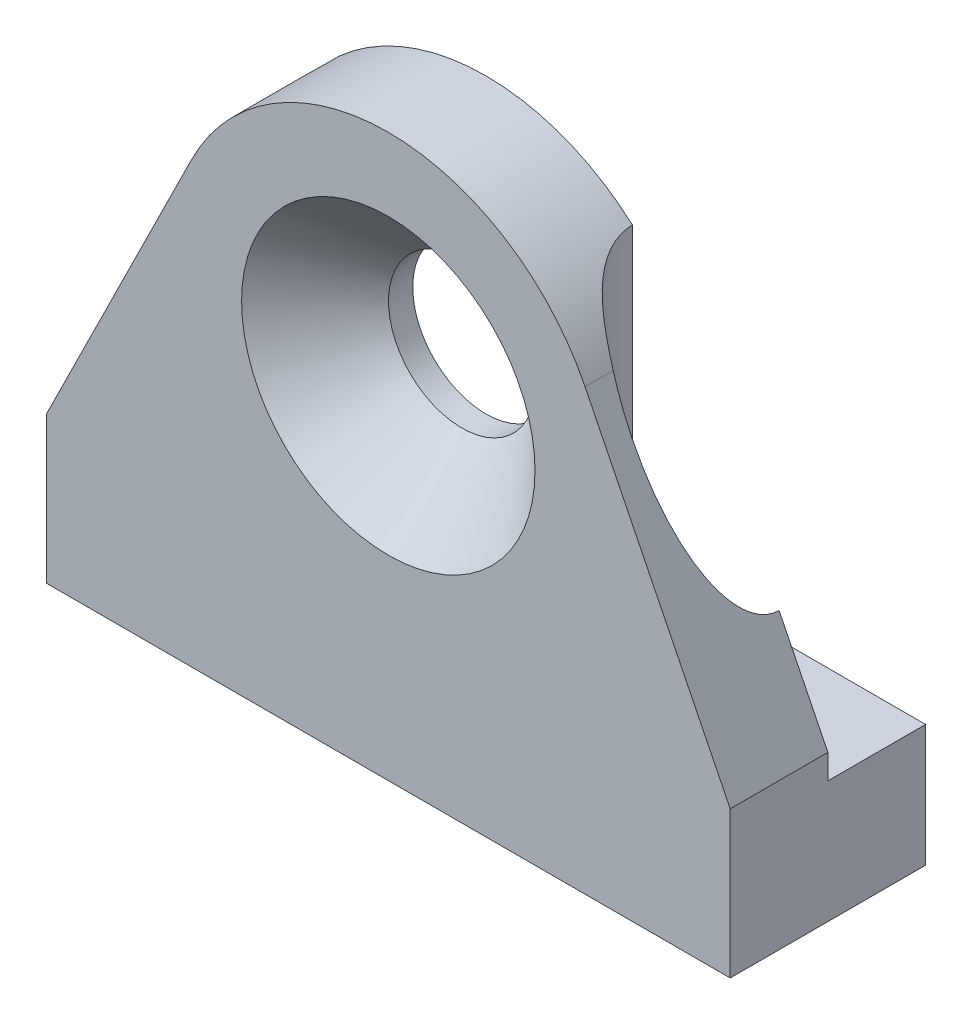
from build123d import *

# Parameters (mm, degrees)
SKETCH2_R           = 4.7625
BOSS_EXTRUDE1_DEPTH = 6.35
SKETCH3_R           = 3.175
CUT_EXTRUDE1_DEPTH  = 50.8
CUT_EXTRUDE2_START  = -6.35
SKETCH4_R           = 4.7625
CUT_EXTRUDE2_DEPTH  = 50.8
SKETCH6_R           = 4.7625
CUT_EXTRUDE6_DEPTH  = 25.4
CHAMFER1_SIZE       = 4.7752


with BuildPart() as part:
    # Sketch2 → Boss-Extrude1 (new, symmetric)
    with BuildSketch(Plane.XY):
        with BuildLine():
            Line((-22.225, -22.225), (22.225, -22.225))
            Line((22.225, -22.225), (22.225, -12.7))
            Line((22.225, -12.7), (12.790425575, 6.338369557))
            ThreePointArc((12.790425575, 6.338369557), (0, 14.2748), (-12.790425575, 6.338369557))
            Line((-12.790425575, 6.338369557), (-22.225, -12.7))
            Line((-22.225, -12.7), (-22.225, -22.225))
        make_face()
        Circle(SKETCH2_R, mode=Mode.SUBTRACT)
    extrude(amount=BOSS_EXTRUDE1_DEPTH, both=True)

    # Sketch3 → Cut-Extrude1 (cut)
    with BuildSketch(Plane.XZ.offset(22.225)):
        with Locations((-14.2875, 0)):
            Circle(SKETCH3_R)
        with Locations((14.2875, 0)):
            Circle(SKETCH3_R)
    extrude(amount=-CUT_EXTRUDE1_DEPTH, mode=Mode.SUBTRACT)

    # Sketch4 → Cut-Extrude2 (cut)
    with BuildSketch(Plane.XZ.offset(22.225).offset(CUT_EXTRUDE2_START)):
        with Locations((-14.2875, 0)):
            Circle(SKETCH4_R)
        with Locations((14.2875, 0)):
            Circle(SKETCH4_R)
    extrude(amount=-CUT_EXTRUDE2_DEPTH, mode=Mode.SUBTRACT)

    # Sketch6 → Cut-Extrude6 (cut)
    with BuildSketch(Plane.XY):
        with BuildLine():
            Line((-22.225, -14.3002), (22.225, -14.3002))
            Line((22.225, -14.3002), (22.225, -12.7))
            Line((22.225, -12.7), (12.790425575, 6.338369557))
            ThreePointArc((12.790425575, 6.338369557), (0, 14.2748), (-12.790425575, 6.338369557))
            Line((-12.790425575, 6.338369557), (-22.225, -12.7))
            Line((-22.225, -12.7), (-22.225, -14.3002))
        make_face()
        Circle(SKETCH6_R, mode=Mode.SUBTRACT)
    extrude(amount=-CUT_EXTRUDE6_DEPTH, mode=Mode.SUBTRACT)

    # Chamfer1
    chamfer1_edges = [part.edges().sort_by_distance(p)[0] for p in [
        (-4.7625, 0, 6.35),
    ]]
    chamfer(chamfer1_edges, length=CHAMFER1_SIZE)


solid = part.part
